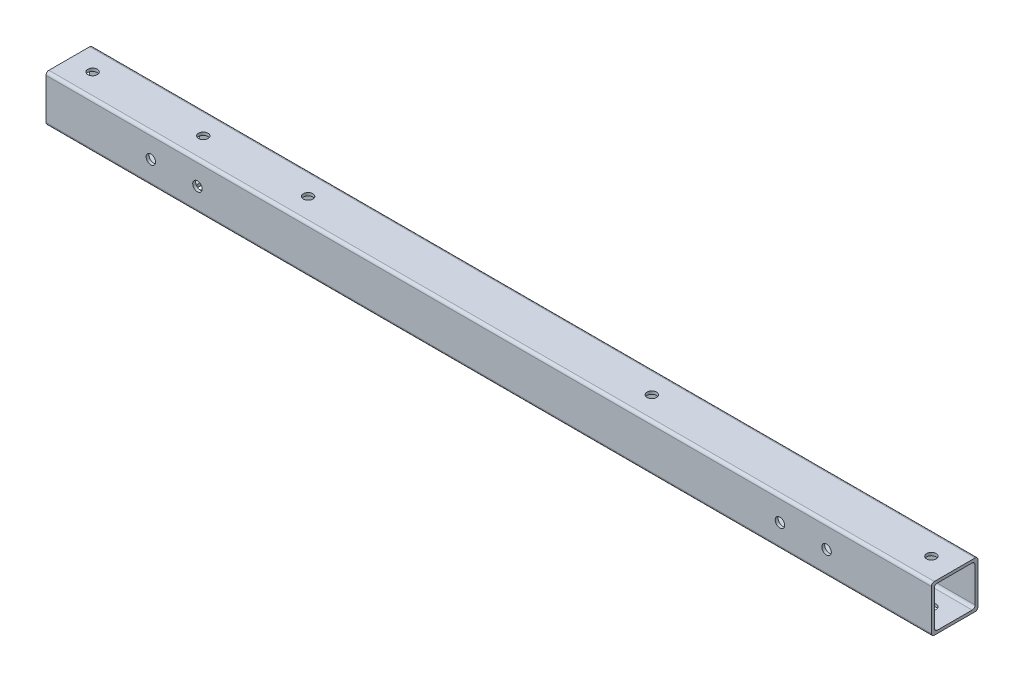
from build123d import *

# Parameters (mm, degrees)
SKETCH1_W          = 1930.4
SKETCH1_H          = 101.6
EXTRUDE1_DEPTH     = 101.6
CUT_EXTRUDE1_REACH = 1937.74
SKETCH2_W          = 88.9
SKETCH2_H          = 88.9
SKETCH3_R          = 10.31875
CUT_EXTRUDE2_DEPTH = 1936.739982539
FILLET1_R          = 6.35
SKETCH5_R          = 10.31875
CUT_EXTRUDE4_DEPTH = 101.6
SKETCH6_R          = 10.31875
CUT_EXTRUDE5_DEPTH = 101.6
SKETCH8_R          = 10.31875
CUT_EXTRUDE7_DEPTH = 101.6
SKETCH9_R          = 10.31875
CUT_EXTRUDE8_DEPTH = 1936.739982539


with BuildPart() as part:
    # Sketch1 → Extrude1 (new body)
    with BuildSketch(Plane(origin=(0, 0, 0), x_dir=(1, 0, 0), z_dir=(0, 1, 0))):
        with Locations((-965.2, -50.8)):
            Rectangle(SKETCH1_W, SKETCH1_H)
    extrude(amount=EXTRUDE1_DEPTH)

    # Sketch2 → Cut-Extrude1 (cut, up to next)
    with BuildSketch(Plane.ZY.offset(1930.4), mode=Mode.PRIVATE) as cut_extrude1_sk1:
        with Locations((50.8, 50.8)):
            Rectangle(SKETCH2_W, SKETCH2_H)
    cut_extrude1_tool1 = extrude(cut_extrude1_sk1.sketch, amount=-CUT_EXTRUDE1_REACH, mode=Mode.PRIVATE) & part.part
    add(cut_extrude1_tool1.solids().sort_by_distance((-1930.4, 50.8, 50.8))[0], mode=Mode.SUBTRACT)

    # Sketch3 → Cut-Extrude2 (cut, through all)
    with BuildSketch(Plane(origin=(0, 101.6, 0), x_dir=(1, 0, 0), z_dir=(0, 1, 0))):
        with Locations(Location((-1879.6, -50.8, 0), (0, 0, 270))):
            Circle(SKETCH3_R)
    cut_extrude2 = extrude(amount=-CUT_EXTRUDE2_DEPTH, mode=Mode.SUBTRACT)

    # Fillet1
    fillet1_edges = [part.edges().sort_by_distance(p)[0] for p in [
        (-965.2, 101.6, 101.6),
        (-965.2, 6.35, 6.35),
        (-965.2, 95.25, 6.35),
        (-965.2, 95.25, 95.25),
        (-965.2, 6.35, 95.25),
        (-965.2, 0, 101.6),
        (-965.2, 0, 0),
        (-965.2, 101.6, 0),
    ]]
    fillet(fillet1_edges, radius=FILLET1_R)

    # Sketch5 → Cut-Extrude4 (cut)
    with BuildSketch(Plane(origin=(0, 0, 0), x_dir=(-1, 0, 0), z_dir=(0, 0, -1))):
        with Locations((1701.8, 50.8)):
            Circle(SKETCH5_R)
        with Locations((1600.2, 50.8)):
            Circle(SKETCH5_R)
    cut_extrude4 = extrude(amount=-CUT_EXTRUDE4_DEPTH, mode=Mode.SUBTRACT)

    # Mirror1: Cut-Extrude2, Cut-Extrude4 across plane
    add(cut_extrude2.mirror(Plane(origin=(-965.2, 0, 0), x_dir=(0, 0, 1), z_dir=(1, 0, 0))), mode=Mode.SUBTRACT)
    add(cut_extrude4.mirror(Plane(origin=(-965.2, 0, 0), x_dir=(0, 0, 1), z_dir=(1, 0, 0))), mode=Mode.SUBTRACT)

    # Sketch6 → Cut-Extrude5 (cut)
    with BuildSketch(Plane(origin=(0, 101.6, 0), x_dir=(1, 0, 0), z_dir=(0, 1, 0))):
        with Locations(Location((-660.4, -50.8, 0), (0, 0, 270))):
            Circle(SKETCH6_R)
    extrude(amount=-CUT_EXTRUDE5_DEPTH, mode=Mode.SUBTRACT)

    # Sketch8 → Cut-Extrude7 (cut)
    with BuildSketch(Plane(origin=(0, 101.6, 0), x_dir=(1, 0, 0), z_dir=(0, 1, 0))):
        with Locations(Location((-1409.7, -50.8, 0), (0, 0, 270))):
            Circle(SKETCH8_R)
    extrude(amount=-CUT_EXTRUDE7_DEPTH, mode=Mode.SUBTRACT)

    # Sketch9 → Cut-Extrude8 (cut, through all)
    with BuildSketch(Plane(origin=(0, 101.6, 0), x_dir=(1, 0, 0), z_dir=(0, 1, 0))):
        with Locations(Location((-1638.3, -50.8, 0), (0, 0, 270))):
            Circle(SKETCH9_R)
    extrude(amount=-CUT_EXTRUDE8_DEPTH, mode=Mode.SUBTRACT)


solid = part.part
